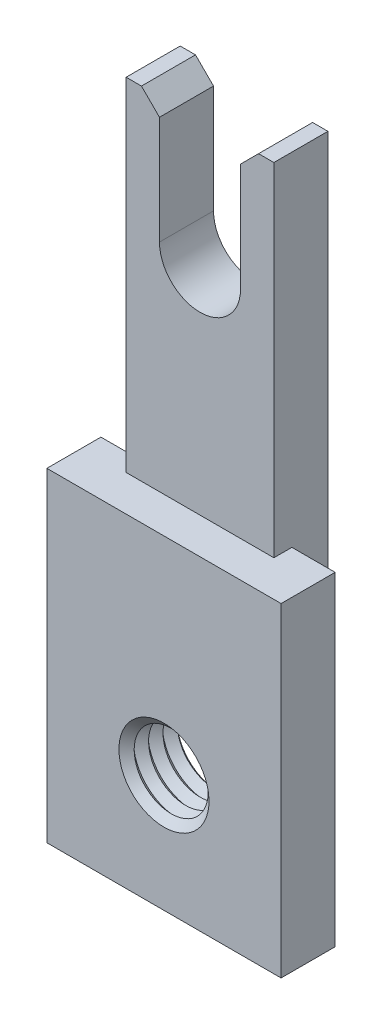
ISO-10303-21;
HEADER;
FILE_DESCRIPTION(('STEP AP214'),'2;1');
FILE_NAME('part.step','',(''),(''),'','','');
FILE_SCHEMA(('AUTOMOTIVE_DESIGN { 1 0 10303 214 1 1 1 1 }'));
ENDSEC;
DATA;
#1=APPLICATION_CONTEXT('core data for automotive mechanical design processes');
#2=APPLICATION_PROTOCOL_DEFINITION('international standard','automotive_design',2000,#1);
#3=PRODUCT_CONTEXT('',#1,'mechanical');
#4=PRODUCT('Part','Part','',(#3));
#5=PRODUCT_RELATED_PRODUCT_CATEGORY('part','',(#4));
#6=PRODUCT_DEFINITION_FORMATION('','',#4);
#7=PRODUCT_DEFINITION_CONTEXT('part definition',#1,'design');
#8=PRODUCT_DEFINITION('design','',#6,#7);
#9=PRODUCT_DEFINITION_SHAPE('','',#8);
#10=(LENGTH_UNIT() NAMED_UNIT(*) SI_UNIT(.MILLI.,.METRE.));
#11=(NAMED_UNIT(*) PLANE_ANGLE_UNIT() SI_UNIT($,.RADIAN.));
#12=(NAMED_UNIT(*) SI_UNIT($,.STERADIAN.) SOLID_ANGLE_UNIT());
#13=UNCERTAINTY_MEASURE_WITH_UNIT(LENGTH_MEASURE(1.E-05),#10,'distance_accuracy_value','');
#14=(GEOMETRIC_REPRESENTATION_CONTEXT(3) GLOBAL_UNCERTAINTY_ASSIGNED_CONTEXT((#13)) GLOBAL_UNIT_ASSIGNED_CONTEXT((#10,
#11,#12)) REPRESENTATION_CONTEXT('',''));
#15=CARTESIAN_POINT('',(0.,0.,0.));
#16=DIRECTION('',(0.,0.,1.));
#17=DIRECTION('',(1.,0.,0.));
#18=AXIS2_PLACEMENT_3D('',#15,#16,#17);
#19=CARTESIAN_POINT('',(0.,0.,0.599999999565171));
#20=DIRECTION('',(0.,0.,-1.));
#21=DIRECTION('',(0.,1.,0.));
#22=AXIS2_PLACEMENT_3D('',#19,#20,#21);
#23=CONICAL_SURFACE('',#22,2.49999999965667,0.839160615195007);
#24=CARTESIAN_POINT('',(0.,0.,0.99999999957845));
#25=DIRECTION('',(0.,0.,1.));
#26=DIRECTION('',(0.,1.,0.));
#27=AXIS2_PLACEMENT_3D('',#24,#25,#26);
#28=CIRCLE('',#27,2.05450000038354);
#29=CARTESIAN_POINT('',(0.,2.05450000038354,0.999999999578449));
#30=VERTEX_POINT('',#29);
#31=EDGE_CURVE('E175',#30,#30,#28,.T.);
#32=ORIENTED_EDGE('',*,*,#31,.T.);
#33=EDGE_LOOP('',(#32));
#34=FACE_BOUND('',#33,.T.);
#35=CARTESIAN_POINT('',(0.,0.,0.600000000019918));
#36=DIRECTION('',(0.,0.,1.));
#37=DIRECTION('',(0.,1.,0.));
#38=AXIS2_PLACEMENT_3D('',#35,#36,#37);
#39=CIRCLE('',#38,2.49999999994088);
#40=CARTESIAN_POINT('',(0.,2.49999999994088,0.600000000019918));
#41=VERTEX_POINT('',#40);
#42=EDGE_CURVE('E170',#41,#41,#39,.F.);
#43=ORIENTED_EDGE('',*,*,#42,.T.);
#44=EDGE_LOOP('',(#43));
#45=FACE_BOUND('',#44,.T.);
#46=ADVANCED_FACE('F15',(#34,#45),#23,.F.);
#47=CARTESIAN_POINT('',(0.,0.,1.39999999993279));
#48=DIRECTION('',(0.,0.,1.));
#49=DIRECTION('',(0.,-1.,0.));
#50=AXIS2_PLACEMENT_3D('',#47,#48,#49);
#51=CONICAL_SURFACE('',#50,2.49999999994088,0.839160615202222);
#52=CARTESIAN_POINT('',(0.,0.,1.39999999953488));
#53=DIRECTION('',(0.,0.,-1.));
#54=DIRECTION('',(0.,1.,0.));
#55=AXIS2_PLACEMENT_3D('',#52,#53,#54);
#56=CIRCLE('',#55,2.49999999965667);
#57=CARTESIAN_POINT('',(0.,2.49999999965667,1.39999999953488));
#58=VERTEX_POINT('',#57);
#59=EDGE_CURVE('E167',#58,#58,#56,.F.);
#60=ORIENTED_EDGE('',*,*,#59,.T.);
#61=EDGE_LOOP('',(#60));
#62=FACE_BOUND('',#61,.T.);
#63=ORIENTED_EDGE('',*,*,#31,.F.);
#64=EDGE_LOOP('',(#63));
#65=FACE_BOUND('',#64,.T.);
#66=ADVANCED_FACE('F384',(#62,#65),#51,.F.);
#67=CARTESIAN_POINT('',(0.,0.,0.600000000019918));
#68=DIRECTION('',(0.,0.,1.));
#69=DIRECTION('',(0.,-1.,0.));
#70=AXIS2_PLACEMENT_3D('',#67,#68,#69);
#71=CONICAL_SURFACE('',#70,2.49999999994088,0.839160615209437);
#72=ORIENTED_EDGE('',*,*,#42,.F.);
#73=EDGE_LOOP('',(#72));
#74=FACE_BOUND('',#73,.T.);
#75=CARTESIAN_POINT('',(0.,0.,0.199999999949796));
#76=DIRECTION('',(0.,0.,-1.));
#77=DIRECTION('',(0.,1.,0.));
#78=AXIS2_PLACEMENT_3D('',#75,#76,#77);
#79=CIRCLE('',#78,2.05450000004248);
#80=CARTESIAN_POINT('',(0.,2.05450000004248,0.199999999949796));
#81=VERTEX_POINT('',#80);
#82=EDGE_CURVE('E230',#81,#81,#79,.T.);
#83=ORIENTED_EDGE('',*,*,#82,.T.);
#84=EDGE_LOOP('',(#83));
#85=FACE_BOUND('',#84,.T.);
#86=ADVANCED_FACE('F380',(#74,#85),#71,.F.);
#87=CARTESIAN_POINT('',(0.,0.,1.39999999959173));
#88=DIRECTION('',(0.,0.,-1.));
#89=DIRECTION('',(0.,1.,0.));
#90=AXIS2_PLACEMENT_3D('',#87,#88,#89);
#91=CONICAL_SURFACE('',#90,2.49999999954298,0.839160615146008);
#92=CARTESIAN_POINT('',(0.,0.,1.79999999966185));
#93=DIRECTION('',(0.,0.,1.));
#94=DIRECTION('',(0.,1.,0.));
#95=AXIS2_PLACEMENT_3D('',#92,#93,#94);
#96=CIRCLE('',#95,2.05450000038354);
#97=CARTESIAN_POINT('',(0.,2.05450000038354,1.79999999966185));
#98=VERTEX_POINT('',#97);
#99=EDGE_CURVE('E227',#98,#98,#96,.T.);
#100=ORIENTED_EDGE('',*,*,#99,.T.);
#101=EDGE_LOOP('',(#100));
#102=FACE_BOUND('',#101,.T.);
#103=ORIENTED_EDGE('',*,*,#59,.F.);
#104=EDGE_LOOP('',(#103));
#105=FACE_BOUND('',#104,.T.);
#106=ADVANCED_FACE('F377',(#102,#105),#91,.F.);
#107=CARTESIAN_POINT('',(4.10000000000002,30.5,-1.99999999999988));
#108=DIRECTION('',(0.,0.,-1.));
#109=DIRECTION('',(0.,-1.,0.));
#110=AXIS2_PLACEMENT_3D('',#107,#108,#109);
#111=PLANE('',#110);
#112=CARTESIAN_POINT('',(0.,23.5,-1.99999999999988));
#113=DIRECTION('',(0.,0.,1.));
#114=DIRECTION('',(1.,0.,0.));
#115=AXIS2_PLACEMENT_3D('',#112,#113,#114);
#116=CIRCLE('',#115,2.25);
#117=CARTESIAN_POINT('',(-2.25,23.5,-1.99999999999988));
#118=VERTEX_POINT('',#117);
#119=CARTESIAN_POINT('',(2.25,23.5,-1.99999999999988));
#120=VERTEX_POINT('',#119);
#121=EDGE_CURVE('E19',#118,#120,#116,.T.);
#122=ORIENTED_EDGE('',*,*,#121,.T.);
#123=DIRECTION('',(0.,1.,0.));
#124=VECTOR('',#123,1.);
#125=CARTESIAN_POINT('',(2.25,30.5,-1.99999999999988));
#126=LINE('',#125,#124);
#127=CARTESIAN_POINT('',(2.25,29.5,-1.99999999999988));
#128=VERTEX_POINT('',#127);
#129=EDGE_CURVE('E131',#120,#128,#126,.T.);
#130=ORIENTED_EDGE('',*,*,#129,.T.);
#131=DIRECTION('',(-0.707106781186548,-0.707106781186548,0.));
#132=VECTOR('',#131,1.);
#133=CARTESIAN_POINT('',(2.75,30.,-1.99999999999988));
#134=LINE('',#133,#132);
#135=CARTESIAN_POINT('',(3.25,30.5,-1.99999999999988));
#136=VERTEX_POINT('',#135);
#137=EDGE_CURVE('E143',#136,#128,#134,.T.);
#138=ORIENTED_EDGE('',*,*,#137,.F.);
#139=DIRECTION('',(1.,0.,0.));
#140=VECTOR('',#139,1.);
#141=CARTESIAN_POINT('',(2.10000000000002,30.5,-1.99999999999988));
#142=LINE('',#141,#140);
#143=CARTESIAN_POINT('',(4.10000000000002,30.5,-1.99999999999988));
#144=VERTEX_POINT('',#143);
#145=EDGE_CURVE('E161',#136,#144,#142,.T.);
#146=ORIENTED_EDGE('',*,*,#145,.T.);
#147=DIRECTION('',(0.,1.,0.));
#148=VECTOR('',#147,1.);
#149=CARTESIAN_POINT('',(4.10000000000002,18.5,-1.99999999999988));
#150=LINE('',#149,#148);
#151=CARTESIAN_POINT('',(4.10000000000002,6.5,-1.99999999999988));
#152=VERTEX_POINT('',#151);
#153=EDGE_CURVE('E184',#152,#144,#150,.T.);
#154=ORIENTED_EDGE('',*,*,#153,.F.);
#155=DIRECTION('',(1.,0.,0.));
#156=VECTOR('',#155,1.);
#157=CARTESIAN_POINT('',(0.,6.5,-1.99999999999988));
#158=LINE('',#157,#156);
#159=CARTESIAN_POINT('',(-4.09999999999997,6.5,-1.99999999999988));
#160=VERTEX_POINT('',#159);
#161=EDGE_CURVE('E160',#160,#152,#158,.T.);
#162=ORIENTED_EDGE('',*,*,#161,.F.);
#163=DIRECTION('',(0.,1.,0.));
#164=VECTOR('',#163,1.);
#165=CARTESIAN_POINT('',(-4.09999999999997,18.5,-1.99999999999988));
#166=LINE('',#165,#164);
#167=CARTESIAN_POINT('',(-4.09999999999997,30.5,-1.99999999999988));
#168=VERTEX_POINT('',#167);
#169=EDGE_CURVE('E222',#160,#168,#166,.T.);
#170=ORIENTED_EDGE('',*,*,#169,.T.);
#171=DIRECTION('',(1.,0.,0.));
#172=VECTOR('',#171,1.);
#173=CARTESIAN_POINT('',(-4.09999999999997,30.5,-1.99999999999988));
#174=LINE('',#173,#172);
#175=CARTESIAN_POINT('',(-3.25,30.5,-1.99999999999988));
#176=VERTEX_POINT('',#175);
#177=EDGE_CURVE('E191',#168,#176,#174,.T.);
#178=ORIENTED_EDGE('',*,*,#177,.T.);
#179=DIRECTION('',(-0.707106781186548,0.707106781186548,0.));
#180=VECTOR('',#179,1.);
#181=CARTESIAN_POINT('',(-2.75,30.,-1.99999999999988));
#182=LINE('',#181,#180);
#183=CARTESIAN_POINT('',(-2.25,29.5,-1.99999999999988));
#184=VERTEX_POINT('',#183);
#185=EDGE_CURVE('E188',#184,#176,#182,.T.);
#186=ORIENTED_EDGE('',*,*,#185,.F.);
#187=DIRECTION('',(0.,1.,0.));
#188=VECTOR('',#187,1.);
#189=CARTESIAN_POINT('',(-2.25,23.5,-1.99999999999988));
#190=LINE('',#189,#188);
#191=EDGE_CURVE('E127',#184,#118,#190,.F.);
#192=ORIENTED_EDGE('',*,*,#191,.T.);
#193=EDGE_LOOP('',(#122,#130,#138,#146,#154,#162,#170,#178,#186,#192));
#194=FACE_BOUND('',#193,.T.);
#195=ADVANCED_FACE('F130',(#194),#111,.T.);
#196=CARTESIAN_POINT('',(2.75,30.,-0.499999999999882));
#197=DIRECTION('',(-0.707106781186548,0.707106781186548,0.));
#198=DIRECTION('',(-0.707106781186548,-0.707106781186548,0.));
#199=AXIS2_PLACEMENT_3D('',#196,#197,#198);
#200=PLANE('',#199);
#201=ORIENTED_EDGE('',*,*,#137,.T.);
#202=DIRECTION('',(0.,0.,-1.));
#203=VECTOR('',#202,1.);
#204=CARTESIAN_POINT('',(2.25,29.5,-1.99999999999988));
#205=LINE('',#204,#203);
#206=CARTESIAN_POINT('',(2.25,29.5,1.00000000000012));
#207=VERTEX_POINT('',#206);
#208=EDGE_CURVE('E137',#128,#207,#205,.F.);
#209=ORIENTED_EDGE('',*,*,#208,.T.);
#210=DIRECTION('',(-0.707106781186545,-0.70710678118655,0.));
#211=VECTOR('',#210,1.);
#212=CARTESIAN_POINT('',(3.25,30.5,1.00000000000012));
#213=LINE('',#212,#211);
#214=CARTESIAN_POINT('',(3.25,30.5,1.00000000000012));
#215=VERTEX_POINT('',#214);
#216=EDGE_CURVE('E183',#215,#207,#213,.T.);
#217=ORIENTED_EDGE('',*,*,#216,.F.);
#218=DIRECTION('',(0.,0.,-1.));
#219=VECTOR('',#218,1.);
#220=CARTESIAN_POINT('',(3.25,30.5,1.00000000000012));
#221=LINE('',#220,#219);
#222=EDGE_CURVE('E157',#215,#136,#221,.T.);
#223=ORIENTED_EDGE('',*,*,#222,.T.);
#224=EDGE_LOOP('',(#201,#209,#217,#223));
#225=FACE_BOUND('',#224,.T.);
#226=ADVANCED_FACE('F349',(#225),#200,.T.);
#227=CARTESIAN_POINT('',(2.25,30.5,-1.99999999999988));
#228=DIRECTION('',(1.,0.,0.));
#229=DIRECTION('',(0.,0.,-1.));
#230=AXIS2_PLACEMENT_3D('',#227,#228,#229);
#231=PLANE('',#230);
#232=ORIENTED_EDGE('',*,*,#129,.F.);
#233=DIRECTION('',(0.,0.,1.));
#234=VECTOR('',#233,1.);
#235=CARTESIAN_POINT('',(2.25,23.5,-1.99999999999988));
#236=LINE('',#235,#234);
#237=CARTESIAN_POINT('',(2.25,23.5,1.00000000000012));
#238=VERTEX_POINT('',#237);
#239=EDGE_CURVE('E136',#120,#238,#236,.T.);
#240=ORIENTED_EDGE('',*,*,#239,.T.);
#241=DIRECTION('',(0.,-1.,0.));
#242=VECTOR('',#241,1.);
#243=CARTESIAN_POINT('',(2.25,21.,1.00000000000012));
#244=LINE('',#243,#242);
#245=EDGE_CURVE('E211',#207,#238,#244,.T.);
#246=ORIENTED_EDGE('',*,*,#245,.F.);
#247=ORIENTED_EDGE('',*,*,#208,.F.);
#248=EDGE_LOOP('',(#232,#240,#246,#247));
#249=FACE_BOUND('',#248,.T.);
#250=ADVANCED_FACE('F140',(#249),#231,.F.);
#251=CARTESIAN_POINT('',(0.,23.5,-1.99999999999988));
#252=DIRECTION('',(0.,0.,1.));
#253=DIRECTION('',(1.,0.,0.));
#254=AXIS2_PLACEMENT_3D('',#251,#252,#253);
#255=CYLINDRICAL_SURFACE('',#254,2.25);
#256=ORIENTED_EDGE('',*,*,#239,.F.);
#257=ORIENTED_EDGE('',*,*,#121,.F.);
#258=DIRECTION('',(0.,0.,1.));
#259=VECTOR('',#258,1.);
#260=CARTESIAN_POINT('',(-2.25,23.5,-1.99999999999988));
#261=LINE('',#260,#259);
#262=CARTESIAN_POINT('',(-2.25,23.5,1.00000000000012));
#263=VERTEX_POINT('',#262);
#264=EDGE_CURVE('E150',#118,#263,#261,.T.);
#265=ORIENTED_EDGE('',*,*,#264,.T.);
#266=CARTESIAN_POINT('',(0.,23.5,1.00000000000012));
#267=DIRECTION('',(0.,0.,1.));
#268=DIRECTION('',(1.,0.,0.));
#269=AXIS2_PLACEMENT_3D('',#266,#267,#268);
#270=CIRCLE('',#269,2.25);
#271=EDGE_CURVE('E147',#238,#263,#270,.F.);
#272=ORIENTED_EDGE('',*,*,#271,.F.);
#273=EDGE_LOOP('',(#256,#257,#265,#272));
#274=FACE_BOUND('',#273,.T.);
#275=ADVANCED_FACE('F145',(#274),#255,.F.);
#276=CARTESIAN_POINT('',(-2.25,23.5,-1.99999999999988));
#277=DIRECTION('',(-1.,0.,0.));
#278=DIRECTION('',(0.,0.,1.));
#279=AXIS2_PLACEMENT_3D('',#276,#277,#278);
#280=PLANE('',#279);
#281=DIRECTION('',(0.,1.,0.));
#282=VECTOR('',#281,1.);
#283=CARTESIAN_POINT('',(-2.25,21.,1.00000000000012));
#284=LINE('',#283,#282);
#285=CARTESIAN_POINT('',(-2.25,29.5,1.00000000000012));
#286=VERTEX_POINT('',#285);
#287=EDGE_CURVE('E210',#263,#286,#284,.T.);
#288=ORIENTED_EDGE('',*,*,#287,.F.);
#289=ORIENTED_EDGE('',*,*,#264,.F.);
#290=ORIENTED_EDGE('',*,*,#191,.F.);
#291=DIRECTION('',(0.,0.,1.));
#292=VECTOR('',#291,1.);
#293=CARTESIAN_POINT('',(-2.25,29.5,-0.499999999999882));
#294=LINE('',#293,#292);
#295=EDGE_CURVE('E154',#286,#184,#294,.F.);
#296=ORIENTED_EDGE('',*,*,#295,.F.);
#297=EDGE_LOOP('',(#288,#289,#290,#296));
#298=FACE_BOUND('',#297,.T.);
#299=ADVANCED_FACE('F240',(#298),#280,.F.);
#300=CARTESIAN_POINT('',(-2.75,30.,-0.499999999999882));
#301=DIRECTION('',(0.707106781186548,0.707106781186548,0.));
#302=DIRECTION('',(-0.707106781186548,0.707106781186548,0.));
#303=AXIS2_PLACEMENT_3D('',#300,#301,#302);
#304=PLANE('',#303);
#305=DIRECTION('',(-0.707106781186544,0.707106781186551,0.));
#306=VECTOR('',#305,1.);
#307=CARTESIAN_POINT('',(-2.25,29.5,1.00000000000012));
#308=LINE('',#307,#306);
#309=CARTESIAN_POINT('',(-3.25,30.5,1.00000000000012));
#310=VERTEX_POINT('',#309);
#311=EDGE_CURVE('E201',#286,#310,#308,.T.);
#312=ORIENTED_EDGE('',*,*,#311,.F.);
#313=ORIENTED_EDGE('',*,*,#295,.T.);
#314=ORIENTED_EDGE('',*,*,#185,.T.);
#315=DIRECTION('',(0.,0.,-1.));
#316=VECTOR('',#315,1.);
#317=CARTESIAN_POINT('',(-3.25,30.5,1.00000000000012));
#318=LINE('',#317,#316);
#319=EDGE_CURVE('E180',#176,#310,#318,.F.);
#320=ORIENTED_EDGE('',*,*,#319,.T.);
#321=EDGE_LOOP('',(#312,#313,#314,#320));
#322=FACE_BOUND('',#321,.T.);
#323=ADVANCED_FACE('F359',(#322),#304,.T.);
#324=CARTESIAN_POINT('',(-4.09999999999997,30.5,1.00000000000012));
#325=DIRECTION('',(0.,-1.,0.));
#326=DIRECTION('',(0.,0.,-1.));
#327=AXIS2_PLACEMENT_3D('',#324,#325,#326);
#328=PLANE('',#327);
#329=ORIENTED_EDGE('',*,*,#177,.F.);
#330=DIRECTION('',(0.,0.,1.));
#331=VECTOR('',#330,1.);
#332=CARTESIAN_POINT('',(-4.09999999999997,30.5,-0.499999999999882));
#333=LINE('',#332,#331);
#334=CARTESIAN_POINT('',(-4.09999999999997,30.5,1.00000000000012));
#335=VERTEX_POINT('',#334);
#336=EDGE_CURVE('E220',#168,#335,#333,.T.);
#337=ORIENTED_EDGE('',*,*,#336,.T.);
#338=DIRECTION('',(-1.,0.,0.));
#339=VECTOR('',#338,1.);
#340=CARTESIAN_POINT('',(0.,30.5,1.00000000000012));
#341=LINE('',#340,#339);
#342=EDGE_CURVE('E198',#310,#335,#341,.T.);
#343=ORIENTED_EDGE('',*,*,#342,.F.);
#344=ORIENTED_EDGE('',*,*,#319,.F.);
#345=EDGE_LOOP('',(#329,#337,#343,#344));
#346=FACE_BOUND('',#345,.T.);
#347=ADVANCED_FACE('F357',(#346),#328,.F.);
#348=CARTESIAN_POINT('',(2.10000000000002,30.5,1.00000000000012));
#349=DIRECTION('',(0.,-1.,0.));
#350=DIRECTION('',(0.,0.,-1.));
#351=AXIS2_PLACEMENT_3D('',#348,#349,#350);
#352=PLANE('',#351);
#353=DIRECTION('',(-1.,0.,0.));
#354=VECTOR('',#353,1.);
#355=CARTESIAN_POINT('',(0.,30.5,1.00000000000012));
#356=LINE('',#355,#354);
#357=CARTESIAN_POINT('',(4.10000000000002,30.5,1.00000000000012));
#358=VERTEX_POINT('',#357);
#359=EDGE_CURVE('E162',#358,#215,#356,.T.);
#360=ORIENTED_EDGE('',*,*,#359,.F.);
#361=DIRECTION('',(0.,0.,1.));
#362=VECTOR('',#361,1.);
#363=CARTESIAN_POINT('',(4.10000000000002,30.5,-0.499999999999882));
#364=LINE('',#363,#362);
#365=EDGE_CURVE('E181',#144,#358,#364,.T.);
#366=ORIENTED_EDGE('',*,*,#365,.F.);
#367=ORIENTED_EDGE('',*,*,#145,.F.);
#368=ORIENTED_EDGE('',*,*,#222,.F.);
#369=EDGE_LOOP('',(#360,#366,#367,#368));
#370=FACE_BOUND('',#369,.T.);
#371=ADVANCED_FACE('F347',(#370),#352,.F.);
#372=CARTESIAN_POINT('',(4.10000000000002,6.5,1.186828E-13));
#373=DIRECTION('',(0.,-1.,0.));
#374=DIRECTION('',(-1.,0.,0.));
#375=AXIS2_PLACEMENT_3D('',#372,#373,#374);
#376=PLANE('',#375);
#377=ORIENTED_EDGE('',*,*,#161,.T.);
#378=DIRECTION('',(0.,0.,-1.));
#379=VECTOR('',#378,1.);
#380=CARTESIAN_POINT('',(4.10000000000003,6.5,-0.499999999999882));
#381=LINE('',#380,#379);
#382=CARTESIAN_POINT('',(4.10000000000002,6.5,0.));
#383=VERTEX_POINT('',#382);
#384=EDGE_CURVE('E186',#383,#152,#381,.T.);
#385=ORIENTED_EDGE('',*,*,#384,.F.);
#386=DIRECTION('',(1.,0.,0.));
#387=VECTOR('',#386,1.);
#388=CARTESIAN_POINT('',(0.,6.5,0.));
#389=LINE('',#388,#387);
#390=CARTESIAN_POINT('',(-4.09999999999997,6.5,0.));
#391=VERTEX_POINT('',#390);
#392=EDGE_CURVE('E327',#391,#383,#389,.T.);
#393=ORIENTED_EDGE('',*,*,#392,.F.);
#394=DIRECTION('',(0.,0.,-1.));
#395=VECTOR('',#394,1.);
#396=CARTESIAN_POINT('',(-4.09999999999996,6.5,-0.499999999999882));
#397=LINE('',#396,#395);
#398=EDGE_CURVE('E224',#391,#160,#397,.T.);
#399=ORIENTED_EDGE('',*,*,#398,.T.);
#400=EDGE_LOOP('',(#377,#385,#393,#399));
#401=FACE_BOUND('',#400,.T.);
#402=ADVANCED_FACE('F352',(#401),#376,.T.);
#403=CARTESIAN_POINT('',(0.,0.,-1.13686332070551E-10));
#404=DIRECTION('',(0.,0.,-1.));
#405=DIRECTION('',(0.,1.,0.));
#406=AXIS2_PLACEMENT_3D('',#403,#404,#405);
#407=CONICAL_SURFACE('',#406,2.27724999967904,0.839160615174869);
#408=ORIENTED_EDGE('',*,*,#82,.F.);
#409=EDGE_LOOP('',(#408));
#410=FACE_BOUND('',#409,.T.);
#411=CARTESIAN_POINT('',(0.,0.,-1.64724194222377E-10));
#412=DIRECTION('',(0.,0.,-1.));
#413=DIRECTION('',(0.,1.,0.));
#414=AXIS2_PLACEMENT_3D('',#411,#412,#413);
#415=CIRCLE('',#414,2.27724999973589);
#416=CARTESIAN_POINT('',(0.,2.27724999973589,-1.64724699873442E-10));
#417=VERTEX_POINT('',#416);
#418=EDGE_CURVE('E203',#417,#417,#415,.F.);
#419=ORIENTED_EDGE('',*,*,#418,.F.);
#420=EDGE_LOOP('',(#419));
#421=FACE_BOUND('',#420,.T.);
#422=ADVANCED_FACE('F396',(#410,#421),#407,.F.);
#423=CARTESIAN_POINT('',(0.,0.,2.20000000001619));
#424=DIRECTION('',(0.,0.,1.));
#425=DIRECTION('',(0.,-1.,0.));
#426=AXIS2_PLACEMENT_3D('',#423,#424,#425);
#427=CONICAL_SURFACE('',#426,2.49999999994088,0.839160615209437);
#428=CARTESIAN_POINT('',(0.,0.,2.19999999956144));
#429=DIRECTION('',(0.,0.,-1.));
#430=DIRECTION('',(0.,1.,0.));
#431=AXIS2_PLACEMENT_3D('',#428,#429,#430);
#432=CIRCLE('',#431,2.49999999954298);
#433=CARTESIAN_POINT('',(0.,2.49999999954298,2.19999999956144));
#434=VERTEX_POINT('',#433);
#435=EDGE_CURVE('E206',#434,#434,#432,.F.);
#436=ORIENTED_EDGE('',*,*,#435,.T.);
#437=EDGE_LOOP('',(#436));
#438=FACE_BOUND('',#437,.T.);
#439=ORIENTED_EDGE('',*,*,#99,.F.);
#440=EDGE_LOOP('',(#439));
#441=FACE_BOUND('',#440,.T.);
#442=ADVANCED_FACE('F398',(#438,#441),#427,.F.);
#443=CARTESIAN_POINT('',(-4.09999999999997,30.5,1.00000000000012));
#444=DIRECTION('',(1.,0.,0.));
#445=DIRECTION('',(0.,-1.,0.));
#446=AXIS2_PLACEMENT_3D('',#443,#444,#445);
#447=PLANE('',#446);
#448=DIRECTION('',(0.,-1.,0.));
#449=VECTOR('',#448,1.);
#450=CARTESIAN_POINT('',(-4.09999999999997,21.,1.00000000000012));
#451=LINE('',#450,#449);
#452=CARTESIAN_POINT('',(-4.09999999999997,11.5,1.00000000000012));
#453=VERTEX_POINT('',#452);
#454=EDGE_CURVE('E200',#335,#453,#451,.T.);
#455=ORIENTED_EDGE('',*,*,#454,.F.);
#456=ORIENTED_EDGE('',*,*,#336,.F.);
#457=ORIENTED_EDGE('',*,*,#169,.F.);
#458=ORIENTED_EDGE('',*,*,#398,.F.);
#459=DIRECTION('',(0.,-1.,0.));
#460=VECTOR('',#459,1.);
#461=CARTESIAN_POINT('',(-4.09999999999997,2.50000000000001,0.));
#462=LINE('',#461,#460);
#463=CARTESIAN_POINT('',(-4.09999999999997,11.5,0.));
#464=VERTEX_POINT('',#463);
#465=EDGE_CURVE('E165',#464,#391,#462,.T.);
#466=ORIENTED_EDGE('',*,*,#465,.F.);
#467=DIRECTION('',(0.,0.,-1.));
#468=VECTOR('',#467,1.);
#469=CARTESIAN_POINT('',(-4.09999999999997,11.5,1.50000000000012));
#470=LINE('',#469,#468);
#471=EDGE_CURVE('E312',#453,#464,#470,.T.);
#472=ORIENTED_EDGE('',*,*,#471,.F.);
#473=EDGE_LOOP('',(#455,#456,#457,#458,#466,#472));
#474=FACE_BOUND('',#473,.T.);
#475=ADVANCED_FACE('F259',(#474),#447,.F.);
#476=CARTESIAN_POINT('',(4.10000000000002,30.5,1.00000000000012));
#477=DIRECTION('',(1.,0.,0.));
#478=DIRECTION('',(0.,-1.,0.));
#479=AXIS2_PLACEMENT_3D('',#476,#477,#478);
#480=PLANE('',#479);
#481=ORIENTED_EDGE('',*,*,#365,.T.);
#482=DIRECTION('',(0.,1.,0.));
#483=VECTOR('',#482,1.);
#484=CARTESIAN_POINT('',(4.10000000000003,21.,1.00000000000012));
#485=LINE('',#484,#483);
#486=CARTESIAN_POINT('',(4.10000000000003,11.5,1.00000000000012));
#487=VERTEX_POINT('',#486);
#488=EDGE_CURVE('E166',#487,#358,#485,.T.);
#489=ORIENTED_EDGE('',*,*,#488,.F.);
#490=DIRECTION('',(0.,0.,1.));
#491=VECTOR('',#490,1.);
#492=CARTESIAN_POINT('',(4.10000000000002,11.5,1.50000000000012));
#493=LINE('',#492,#491);
#494=CARTESIAN_POINT('',(4.10000000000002,11.5,0.));
#495=VERTEX_POINT('',#494);
#496=EDGE_CURVE('E302',#495,#487,#493,.T.);
#497=ORIENTED_EDGE('',*,*,#496,.F.);
#498=DIRECTION('',(0.,1.,0.));
#499=VECTOR('',#498,1.);
#500=CARTESIAN_POINT('',(4.10000000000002,2.50000000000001,0.));
#501=LINE('',#500,#499);
#502=EDGE_CURVE('E207',#383,#495,#501,.T.);
#503=ORIENTED_EDGE('',*,*,#502,.F.);
#504=ORIENTED_EDGE('',*,*,#384,.T.);
#505=ORIENTED_EDGE('',*,*,#153,.T.);
#506=EDGE_LOOP('',(#481,#489,#497,#503,#504,#505));
#507=FACE_BOUND('',#506,.T.);
#508=ADVANCED_FACE('F248',(#507),#480,.T.);
#509=CARTESIAN_POINT('',(4.10000000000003,11.5,1.00000000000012));
#510=DIRECTION('',(0.,0.,1.));
#511=DIRECTION('',(0.,1.,0.));
#512=AXIS2_PLACEMENT_3D('',#509,#510,#511);
#513=PLANE('',#512);
#514=ORIENTED_EDGE('',*,*,#488,.T.);
#515=ORIENTED_EDGE('',*,*,#359,.T.);
#516=ORIENTED_EDGE('',*,*,#216,.T.);
#517=ORIENTED_EDGE('',*,*,#245,.T.);
#518=ORIENTED_EDGE('',*,*,#271,.T.);
#519=ORIENTED_EDGE('',*,*,#287,.T.);
#520=ORIENTED_EDGE('',*,*,#311,.T.);
#521=ORIENTED_EDGE('',*,*,#342,.T.);
#522=ORIENTED_EDGE('',*,*,#454,.T.);
#523=DIRECTION('',(-1.,0.,0.));
#524=VECTOR('',#523,1.);
#525=CARTESIAN_POINT('',(0.,11.5,1.00000000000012));
#526=LINE('',#525,#524);
#527=EDGE_CURVE('E299',#487,#453,#526,.T.);
#528=ORIENTED_EDGE('',*,*,#527,.F.);
#529=EDGE_LOOP('',(#514,#515,#516,#517,#518,#519,#520,#521,#522,#528));
#530=FACE_BOUND('',#529,.T.);
#531=ADVANCED_FACE('F244',(#530),#513,.T.);
#532=CARTESIAN_POINT('',(6.5,11.5,0.));
#533=DIRECTION('',(0.,0.,-1.));
#534=DIRECTION('',(0.,-1.,0.));
#535=AXIS2_PLACEMENT_3D('',#532,#533,#534);
#536=PLANE('',#535);
#537=ORIENTED_EDGE('',*,*,#418,.T.);
#538=EDGE_LOOP('',(#537));
#539=FACE_BOUND('',#538,.T.);
#540=DIRECTION('',(-1.,0.,0.));
#541=VECTOR('',#540,1.);
#542=CARTESIAN_POINT('',(0.,11.5,1.1723955E-13));
#543=LINE('',#542,#541);
#544=CARTESIAN_POINT('',(6.5,11.5,0.));
#545=VERTEX_POINT('',#544);
#546=EDGE_CURVE('E305',#545,#495,#543,.T.);
#547=ORIENTED_EDGE('',*,*,#546,.F.);
#548=DIRECTION('',(0.,1.,0.));
#549=VECTOR('',#548,1.);
#550=CARTESIAN_POINT('',(6.5,2.5,0.));
#551=LINE('',#550,#549);
#552=CARTESIAN_POINT('',(6.5,-6.49999999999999,0.));
#553=VERTEX_POINT('',#552);
#554=EDGE_CURVE('E315',#553,#545,#551,.T.);
#555=ORIENTED_EDGE('',*,*,#554,.F.);
#556=DIRECTION('',(1.,0.,0.));
#557=VECTOR('',#556,1.);
#558=CARTESIAN_POINT('',(0.,-6.5,0.));
#559=LINE('',#558,#557);
#560=CARTESIAN_POINT('',(-6.5,-6.49999999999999,0.));
#561=VERTEX_POINT('',#560);
#562=EDGE_CURVE('E320',#561,#553,#559,.T.);
#563=ORIENTED_EDGE('',*,*,#562,.F.);
#564=DIRECTION('',(0.,1.,0.));
#565=VECTOR('',#564,1.);
#566=CARTESIAN_POINT('',(-6.5,2.5,0.));
#567=LINE('',#566,#565);
#568=CARTESIAN_POINT('',(-6.5,11.5,0.));
#569=VERTEX_POINT('',#568);
#570=EDGE_CURVE('E294',#561,#569,#567,.T.);
#571=ORIENTED_EDGE('',*,*,#570,.T.);
#572=DIRECTION('',(-1.,0.,0.));
#573=VECTOR('',#572,1.);
#574=CARTESIAN_POINT('',(0.,11.5,1.1723955E-13));
#575=LINE('',#574,#573);
#576=EDGE_CURVE('E310',#464,#569,#575,.T.);
#577=ORIENTED_EDGE('',*,*,#576,.F.);
#578=ORIENTED_EDGE('',*,*,#465,.T.);
#579=ORIENTED_EDGE('',*,*,#392,.T.);
#580=ORIENTED_EDGE('',*,*,#502,.T.);
#581=EDGE_LOOP('',(#547,#555,#563,#571,#577,#578,#579,#580));
#582=FACE_BOUND('',#581,.T.);
#583=ADVANCED_FACE('F247',(#539,#582),#536,.T.);
#584=CARTESIAN_POINT('',(0.,0.,2.19999999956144));
#585=DIRECTION('',(0.,0.,-1.));
#586=DIRECTION('',(0.,1.,0.));
#587=AXIS2_PLACEMENT_3D('',#584,#585,#586);
#588=CONICAL_SURFACE('',#587,2.49999999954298,0.839160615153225);
#589=CARTESIAN_POINT('',(0.,0.,2.59999999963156));
#590=DIRECTION('',(0.,0.,1.));
#591=DIRECTION('',(0.,1.,0.));
#592=AXIS2_PLACEMENT_3D('',#589,#590,#591);
#593=CIRCLE('',#592,2.05450000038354);
#594=CARTESIAN_POINT('',(0.,2.05450000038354,2.59999999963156));
#595=VERTEX_POINT('',#594);
#596=EDGE_CURVE('E288',#595,#595,#593,.T.);
#597=ORIENTED_EDGE('',*,*,#596,.T.);
#598=EDGE_LOOP('',(#597));
#599=FACE_BOUND('',#598,.T.);
#600=ORIENTED_EDGE('',*,*,#435,.F.);
#601=EDGE_LOOP('',(#600));
#602=FACE_BOUND('',#601,.T.);
#603=ADVANCED_FACE('F256',(#599,#602),#588,.F.);
#604=CARTESIAN_POINT('',(6.5,-6.5,3.00000000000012));
#605=DIRECTION('',(0.,-1.,0.));
#606=DIRECTION('',(-1.,0.,0.));
#607=AXIS2_PLACEMENT_3D('',#604,#605,#606);
#608=PLANE('',#607);
#609=ORIENTED_EDGE('',*,*,#562,.T.);
#610=DIRECTION('',(0.,0.,-1.));
#611=VECTOR('',#610,1.);
#612=CARTESIAN_POINT('',(6.5,-6.5,1.50000000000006));
#613=LINE('',#612,#611);
#614=CARTESIAN_POINT('',(6.5,-6.5,3.00000000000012));
#615=VERTEX_POINT('',#614);
#616=EDGE_CURVE('E317',#615,#553,#613,.T.);
#617=ORIENTED_EDGE('',*,*,#616,.F.);
#618=DIRECTION('',(1.,0.,0.));
#619=VECTOR('',#618,1.);
#620=CARTESIAN_POINT('',(0.,-6.5,3.00000000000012));
#621=LINE('',#620,#619);
#622=CARTESIAN_POINT('',(-6.5,-6.5,3.00000000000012));
#623=VERTEX_POINT('',#622);
#624=EDGE_CURVE('E284',#623,#615,#621,.T.);
#625=ORIENTED_EDGE('',*,*,#624,.F.);
#626=DIRECTION('',(0.,0.,-1.));
#627=VECTOR('',#626,1.);
#628=CARTESIAN_POINT('',(-6.5,-6.5,1.50000000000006));
#629=LINE('',#628,#627);
#630=EDGE_CURVE('E296',#623,#561,#629,.T.);
#631=ORIENTED_EDGE('',*,*,#630,.T.);
#632=EDGE_LOOP('',(#609,#617,#625,#631));
#633=FACE_BOUND('',#632,.T.);
#634=ADVANCED_FACE('F457',(#633),#608,.T.);
#635=CARTESIAN_POINT('',(6.5,11.5,3.00000000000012));
#636=DIRECTION('',(1.,0.,0.));
#637=DIRECTION('',(0.,-1.,0.));
#638=AXIS2_PLACEMENT_3D('',#635,#636,#637);
#639=PLANE('',#638);
#640=DIRECTION('',(0.,0.,-1.));
#641=VECTOR('',#640,1.);
#642=CARTESIAN_POINT('',(6.5,11.5,1.50000000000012));
#643=LINE('',#642,#641);
#644=CARTESIAN_POINT('',(6.5,11.5,3.00000000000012));
#645=VERTEX_POINT('',#644);
#646=EDGE_CURVE('E308',#645,#545,#643,.T.);
#647=ORIENTED_EDGE('',*,*,#646,.F.);
#648=DIRECTION('',(0.,1.,0.));
#649=VECTOR('',#648,1.);
#650=CARTESIAN_POINT('',(6.5,2.5,3.00000000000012));
#651=LINE('',#650,#649);
#652=EDGE_CURVE('E280',#615,#645,#651,.T.);
#653=ORIENTED_EDGE('',*,*,#652,.F.);
#654=ORIENTED_EDGE('',*,*,#616,.T.);
#655=ORIENTED_EDGE('',*,*,#554,.T.);
#656=EDGE_LOOP('',(#647,#653,#654,#655));
#657=FACE_BOUND('',#656,.T.);
#658=ADVANCED_FACE('F463',(#657),#639,.T.);
#659=CARTESIAN_POINT('',(-6.5,11.5,3.00000000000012));
#660=DIRECTION('',(0.,1.,0.));
#661=DIRECTION('',(1.,0.,0.));
#662=AXIS2_PLACEMENT_3D('',#659,#660,#661);
#663=PLANE('',#662);
#664=ORIENTED_EDGE('',*,*,#496,.T.);
#665=ORIENTED_EDGE('',*,*,#527,.T.);
#666=ORIENTED_EDGE('',*,*,#471,.T.);
#667=ORIENTED_EDGE('',*,*,#576,.T.);
#668=DIRECTION('',(0.,0.,1.));
#669=VECTOR('',#668,1.);
#670=CARTESIAN_POINT('',(-6.5,11.5,1.50000000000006));
#671=LINE('',#670,#669);
#672=CARTESIAN_POINT('',(-6.5,11.5,3.00000000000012));
#673=VERTEX_POINT('',#672);
#674=EDGE_CURVE('E34',#569,#673,#671,.T.);
#675=ORIENTED_EDGE('',*,*,#674,.T.);
#676=DIRECTION('',(-1.,0.,0.));
#677=VECTOR('',#676,1.);
#678=CARTESIAN_POINT('',(0.,11.5,3.00000000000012));
#679=LINE('',#678,#677);
#680=EDGE_CURVE('E277',#645,#673,#679,.T.);
#681=ORIENTED_EDGE('',*,*,#680,.F.);
#682=ORIENTED_EDGE('',*,*,#646,.T.);
#683=ORIENTED_EDGE('',*,*,#546,.T.);
#684=EDGE_LOOP('',(#664,#665,#666,#667,#675,#681,#682,#683));
#685=FACE_BOUND('',#684,.T.);
#686=ADVANCED_FACE('F337',(#685),#663,.T.);
#687=CARTESIAN_POINT('',(-6.5,11.5,3.00000000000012));
#688=DIRECTION('',(1.,0.,0.));
#689=DIRECTION('',(0.,-1.,0.));
#690=AXIS2_PLACEMENT_3D('',#687,#688,#689);
#691=PLANE('',#690);
#692=ORIENTED_EDGE('',*,*,#674,.F.);
#693=ORIENTED_EDGE('',*,*,#570,.F.);
#694=ORIENTED_EDGE('',*,*,#630,.F.);
#695=DIRECTION('',(0.,-1.,0.));
#696=VECTOR('',#695,1.);
#697=CARTESIAN_POINT('',(-6.5,2.5,3.00000000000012));
#698=LINE('',#697,#696);
#699=EDGE_CURVE('E25',#673,#623,#698,.T.);
#700=ORIENTED_EDGE('',*,*,#699,.F.);
#701=EDGE_LOOP('',(#692,#693,#694,#700));
#702=FACE_BOUND('',#701,.T.);
#703=ADVANCED_FACE('F269',(#702),#691,.F.);
#704=CARTESIAN_POINT('',(0.,0.,2.9999999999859));
#705=DIRECTION('',(0.,0.,1.));
#706=DIRECTION('',(0.,-1.,0.));
#707=AXIS2_PLACEMENT_3D('',#704,#705,#706);
#708=CONICAL_SURFACE('',#707,2.49999999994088,0.839160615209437);
#709=CARTESIAN_POINT('',(0.,0.,2.9999999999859));
#710=DIRECTION('',(0.,0.,1.));
#711=DIRECTION('',(0.,-1.,0.));
#712=AXIS2_PLACEMENT_3D('',#709,#710,#711);
#713=CIRCLE('',#712,2.49999999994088);
#714=CARTESIAN_POINT('',(0.,-2.49999999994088,2.9999999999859));
#715=VERTEX_POINT('',#714);
#716=EDGE_CURVE('E10',#715,#715,#713,.F.);
#717=ORIENTED_EDGE('',*,*,#716,.F.);
#718=EDGE_LOOP('',(#717));
#719=FACE_BOUND('',#718,.T.);
#720=ORIENTED_EDGE('',*,*,#596,.F.);
#721=EDGE_LOOP('',(#720));
#722=FACE_BOUND('',#721,.T.);
#723=ADVANCED_FACE('F263',(#719,#722),#708,.F.);
#724=CARTESIAN_POINT('',(6.5,-6.5,3.00000000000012));
#725=DIRECTION('',(0.,0.,1.));
#726=DIRECTION('',(0.,1.,0.));
#727=AXIS2_PLACEMENT_3D('',#724,#725,#726);
#728=PLANE('',#727);
#729=ORIENTED_EDGE('',*,*,#716,.T.);
#730=EDGE_LOOP('',(#729));
#731=FACE_BOUND('',#730,.T.);
#732=ORIENTED_EDGE('',*,*,#680,.T.);
#733=ORIENTED_EDGE('',*,*,#699,.T.);
#734=ORIENTED_EDGE('',*,*,#624,.T.);
#735=ORIENTED_EDGE('',*,*,#652,.T.);
#736=EDGE_LOOP('',(#732,#733,#734,#735));
#737=FACE_BOUND('',#736,.T.);
#738=ADVANCED_FACE('F17',(#731,#737),#728,.T.);
#739=CLOSED_SHELL('',(#46,#66,#86,#106,#195,#226,#250,#275,#299,#323,#347,#371,#402,#422,#442,
#475,#508,#531,#583,#603,#634,#658,#686,#703,#723,#738));
#740=MANIFOLD_SOLID_BREP('B1',#739);
#741=ADVANCED_BREP_SHAPE_REPRESENTATION('',(#18,#740),#14);
#742=SHAPE_DEFINITION_REPRESENTATION(#9,#741);
ENDSEC;
END-ISO-10303-21;
